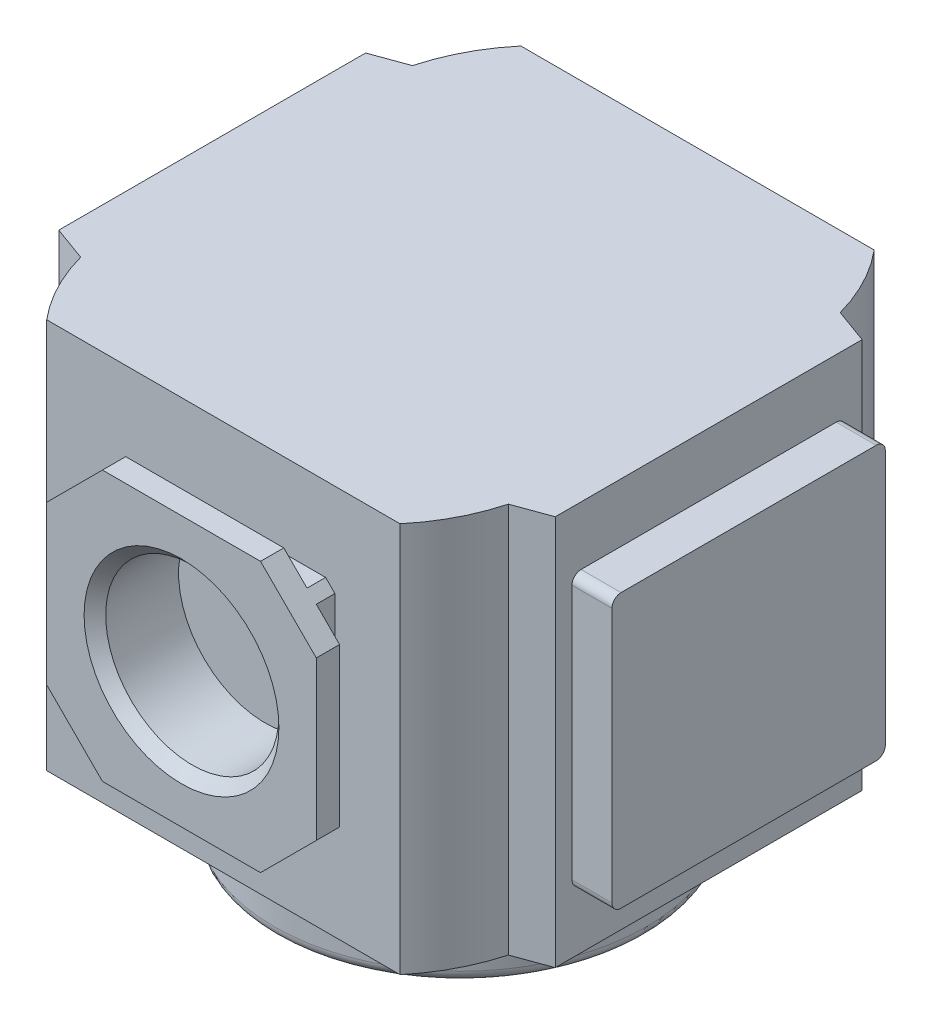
from build123d import *

# Parameters (mm, degrees)
EXTRUDE_1_DEPTH      = 21
EXTRUDE_1_DEPTH_BACK = 21
EXTRUDE_2_DEPTH      = 21
EXTRUDE_2_DEPTH_BACK = 21
EXTRUDE_3_DEPTH      = 21
EXTRUDE_3_DEPTH_BACK = 21
EXTRUDE_4_DEPTH      = 2
EXTRUDE_5_DEPTH      = 2.5
EXTRUDE_6_DEPTH      = 2
EXTRUDE_7_DEPTH      = 2.5
CUT_EXTRUDE_1_DEPTH  = 1
EXTRUDE_8_DEPTH      = 1
EXTRUDE_9_DEPTH      = 4.3


with BuildPart() as part:
    # Sketch 1 → Extrude 1 (new, two sides: drawn at the far end of the back side and taken through both)
    with BuildSketch(Plane(origin=(0, 0, 0), x_dir=(1, 0, 0), z_dir=(0, 1, 0)).offset(-EXTRUDE_1_DEPTH_BACK)):
        with BuildLine():
            Line((-19, -25.5), (19, -25.5))
            ThreePointArc((19, -25.5), (21.41799571, -21.891810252), (23, -17.846689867))
            Line((23, -17.846689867), (23, 17.846689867))
            ThreePointArc((23, 17.846689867), (21.41799571, 21.891810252), (19, 25.5))
            Line((19, 25.5), (-19, 25.5))
            ThreePointArc((-19, 25.5), (-21.41799571, 21.891810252), (-23, 17.846689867))
            Line((-23, 17.846689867), (-23, -17.846689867))
            ThreePointArc((-23, -17.846689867), (-21.41799571, -21.891810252), (-19, -25.5))
        make_face()
    extrude(amount=EXTRUDE_1_DEPTH + EXTRUDE_1_DEPTH_BACK)

    # Sketch 2 → Extrude 2 (add, two sides: drawn at the far end of the back side and taken through both)
    with BuildSketch(Plane(origin=(0, 0, 0), x_dir=(1, 0, 0), z_dir=(0, 1, 0)).offset(-EXTRUDE_2_DEPTH_BACK)):
        Polygon((-26.7, 16.5), (-26.7, -16.5), (-23, -17.846689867), (-23, 17.846689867), align=None)
    extrude(amount=EXTRUDE_2_DEPTH + EXTRUDE_2_DEPTH_BACK)

    # Sketch 3 → Extrude 3 (add, two sides: drawn at the far end of the back side and taken through both)
    with BuildSketch(Plane(origin=(0, 0, 0), x_dir=(1, 0, 0), z_dir=(0, 1, 0)).offset(-EXTRUDE_3_DEPTH_BACK)):
        Polygon((23, -17.846689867), (26.7, -16.5), (26.7, 16.5), (23, 17.846689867), align=None)
    extrude(amount=EXTRUDE_3_DEPTH + EXTRUDE_3_DEPTH_BACK)

    # Sketch 4 → Revolve 1 (revolve)
    with BuildSketch(Plane.XY, mode=Mode.PRIVATE) as revolve_1_sk:
        with BuildLine():
            Line((0, -21), (20.1, -21))
            Line((20.1, -21), (20.1, -23))
            Line((20.1, -23), (20, -23))
            Line((20, -23), (20, -28.8))
            ThreePointArc((20, -28.8), (19.648528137, -29.648528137), (18.8, -30))
            Line((18.8, -30), (0, -30))
            Line((0, -30), (0, -21))
        make_face()
    revolve(revolve_1_sk.sketch.rotate(Axis((0, -30, 0), (0, 1, 0)), 270), axis=Axis((0, -30, 0), (0, 1, 0)))

    # Sketch 5 → Extrude 4 (add)
    with BuildSketch(Plane.XY.offset(25.5)):
        Polygon((-12, 11), (-12, -11), (-11, -12), (11, -12), (12, -11), (12, 11), (11, 12), (-11, 12), align=None)
    extrude(amount=EXTRUDE_4_DEPTH)

    # Sketch 6 → Extrude 5 (add)
    with BuildSketch(Plane.XY.offset(27.5)):
        Polygon((-14.5, 8.5), (-14.5, -8.5), (-8.5, -14.5), (8.5, -14.5), (14.5, -8.5), (14.5, 8.5), (8.5, 14.5), (-8.5, 14.5), align=None)
    extrude(amount=EXTRUDE_5_DEPTH)

    # Sketch 7 → Extrude 6 (add)
    with BuildSketch(Plane.XY.offset(-25.5)):
        Polygon((-12, 11), (-12, -11), (-11, -12), (11, -12), (12, -11), (12, 11), (11, 12), (-11, 12), align=None)
    extrude(amount=-EXTRUDE_6_DEPTH)

    # Sketch 8 → Extrude 7 (add)
    with BuildSketch(Plane.XY.offset(-27.5)):
        Polygon((-14.5, 8.5), (-14.5, -8.5), (-8.5, -14.5), (8.5, -14.5), (14.5, -8.5), (14.5, 8.5), (8.5, 14.5), (-8.5, 14.5), align=None)
    extrude(amount=-EXTRUDE_7_DEPTH)

    # Sketch 9 → Cut-Revolve 1 (revolve, cut)
    with BuildSketch(Plane(origin=(0, 0, 0), x_dir=(0, 0, -1), z_dir=(1, 0, 0)), mode=Mode.PRIVATE) as cut_revolve_1_sk:
        Polygon((21, 0), (21, 9.3155), (28.838, 9.3155), (30, 10.4775), (30, 0), align=None)
    revolve(cut_revolve_1_sk.sketch.rotate(Axis((0, 0, -30), (0, 0, 1)), 270), axis=Axis((0, 0, -30), (0, 0, 1)), mode=Mode.SUBTRACT)

    # Sketch 10 → Cut-Revolve 2 (revolve, cut)
    with BuildSketch(Plane(origin=(0, 0, 0), x_dir=(0, 0, -1), z_dir=(1, 0, 0)), mode=Mode.PRIVATE) as cut_revolve_2_sk:
        Polygon((-30, 0), (-30, 10.4775), (-28.838, 9.3155), (-21, 9.3155), (-21, 0), align=None)
    revolve(cut_revolve_2_sk.sketch.rotate(Axis((0, 0, 21), (0, 0, 1)), 270), axis=Axis((0, 0, 21), (0, 0, 1)), mode=Mode.SUBTRACT)

    # Sketch 11 → Cut-Extrude 1 (cut)
    with BuildSketch(Plane(origin=(-26.7, 0, 0), x_dir=(0, 0, -1), z_dir=(1, 0, 0))):
        with BuildLine():
            Line((-14, -15), (14, -15))
            ThreePointArc((14, -15), (14.707106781, -14.707106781), (15, -14))
            Line((15, -14), (15, 14))
            ThreePointArc((15, 14), (14.707106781, 14.707106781), (14, 15))
            Line((14, 15), (-14, 15))
            ThreePointArc((-14, 15), (-14.707106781, 14.707106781), (-15, 14))
            Line((-15, 14), (-15, -14))
            ThreePointArc((-15, -14), (-14.707106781, -14.707106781), (-14, -15))
        make_face()
    extrude(amount=CUT_EXTRUDE_1_DEPTH, mode=Mode.SUBTRACT)

    # Sketch 12 → Extrude 8 (add)
    with BuildSketch(Plane(origin=(-26.7, 0, 0), x_dir=(0, 0, -1), z_dir=(1, 0, 0))):
        with BuildLine():
            Line((-13.72, -14.7), (13.72, -14.7))
            ThreePointArc((13.72, -14.7), (14.412964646, -14.412964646), (14.7, -13.72))
            Line((14.7, -13.72), (14.7, 13.72))
            ThreePointArc((14.7, 13.72), (14.412964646, 14.412964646), (13.72, 14.7))
            Line((13.72, 14.7), (-13.72, 14.7))
            ThreePointArc((-13.72, 14.7), (-14.412964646, 14.412964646), (-14.7, 13.72))
            Line((-14.7, 13.72), (-14.7, -13.72))
            ThreePointArc((-14.7, -13.72), (-14.412964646, -14.412964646), (-13.72, -14.7))
        make_face()
    extrude(amount=EXTRUDE_8_DEPTH)

    # Sketch 13 → Extrude 9 (add)
    with BuildSketch(Plane(origin=(26.7, 0, 0), x_dir=(0, 0, -1), z_dir=(1, 0, 0))):
        with BuildLine():
            Line((-13.72, -14.7), (13.72, -14.7))
            ThreePointArc((13.72, -14.7), (14.412964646, -14.412964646), (14.7, -13.72))
            Line((14.7, -13.72), (14.7, 13.72))
            ThreePointArc((14.7, 13.72), (14.412964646, 14.412964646), (13.72, 14.7))
            Line((13.72, 14.7), (-13.72, 14.7))
            ThreePointArc((-13.72, 14.7), (-14.412964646, 14.412964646), (-14.7, 13.72))
            Line((-14.7, 13.72), (-14.7, -13.72))
            ThreePointArc((-14.7, -13.72), (-14.412964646, -14.412964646), (-13.72, -14.7))
        make_face()
    extrude(amount=EXTRUDE_9_DEPTH)


solid = part.part
